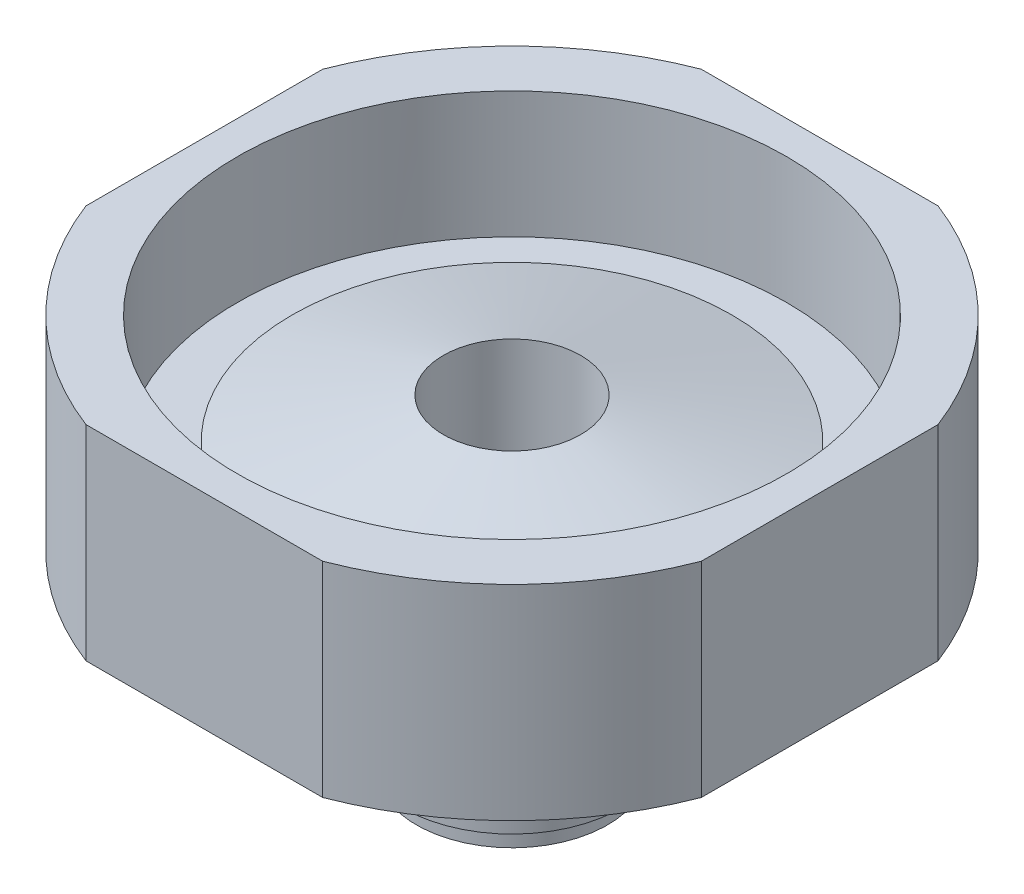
ISO-10303-21;
HEADER;
FILE_DESCRIPTION(('STEP AP214'),'2;1');
FILE_NAME('part.step','',(''),(''),'','','');
FILE_SCHEMA(('AUTOMOTIVE_DESIGN { 1 0 10303 214 1 1 1 1 }'));
ENDSEC;
DATA;
#1=APPLICATION_CONTEXT('core data for automotive mechanical design processes');
#2=APPLICATION_PROTOCOL_DEFINITION('international standard','automotive_design',2000,#1);
#3=PRODUCT_CONTEXT('',#1,'mechanical');
#4=PRODUCT('Part','Part','',(#3));
#5=PRODUCT_RELATED_PRODUCT_CATEGORY('part','',(#4));
#6=PRODUCT_DEFINITION_FORMATION('','',#4);
#7=PRODUCT_DEFINITION_CONTEXT('part definition',#1,'design');
#8=PRODUCT_DEFINITION('design','',#6,#7);
#9=PRODUCT_DEFINITION_SHAPE('','',#8);
#10=(LENGTH_UNIT() NAMED_UNIT(*) SI_UNIT(.MILLI.,.METRE.));
#11=(NAMED_UNIT(*) PLANE_ANGLE_UNIT() SI_UNIT($,.RADIAN.));
#12=(NAMED_UNIT(*) SI_UNIT($,.STERADIAN.) SOLID_ANGLE_UNIT());
#13=UNCERTAINTY_MEASURE_WITH_UNIT(LENGTH_MEASURE(1.E-05),#10,'distance_accuracy_value','');
#14=(GEOMETRIC_REPRESENTATION_CONTEXT(3) GLOBAL_UNCERTAINTY_ASSIGNED_CONTEXT((#13)) GLOBAL_UNIT_ASSIGNED_CONTEXT((#10,
#11,#12)) REPRESENTATION_CONTEXT('',''));
#15=CARTESIAN_POINT('',(0.,0.,0.));
#16=DIRECTION('',(0.,0.,1.));
#17=DIRECTION('',(1.,0.,0.));
#18=AXIS2_PLACEMENT_3D('',#15,#16,#17);
#19=CARTESIAN_POINT('',(0.,0.,0.));
#20=DIRECTION('',(0.,-1.,0.));
#21=DIRECTION('',(0.,0.,-0.999999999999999));
#22=AXIS2_PLACEMENT_3D('',#19,#20,#21);
#23=CYLINDRICAL_SURFACE('',#22,19.05);
#24=DIRECTION('',(0.,-1.,0.));
#25=VECTOR('',#24,1.);
#26=CARTESIAN_POINT('',(6.83915930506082,0.,17.78));
#27=LINE('',#26,#25);
#28=CARTESIAN_POINT('',(6.83915930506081,-2.29966349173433,17.78));
#29=VERTEX_POINT('',#28);
#30=CARTESIAN_POINT('',(6.83915930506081,9.52500000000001,17.78));
#31=VERTEX_POINT('',#30);
#32=EDGE_CURVE('E11',#29,#31,#27,.F.);
#33=ORIENTED_EDGE('',*,*,#32,.F.);
#34=CARTESIAN_POINT('',(0.,-2.29966349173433,0.));
#35=DIRECTION('',(0.,-1.,0.));
#36=DIRECTION('',(0.,0.,-0.999999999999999));
#37=AXIS2_PLACEMENT_3D('',#34,#35,#36);
#38=CIRCLE('',#37,19.05);
#39=CARTESIAN_POINT('',(17.7799999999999,-2.29966349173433,6.83915930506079));
#40=VERTEX_POINT('',#39);
#41=EDGE_CURVE('E138',#40,#29,#38,.T.);
#42=ORIENTED_EDGE('',*,*,#41,.F.);
#43=DIRECTION('',(0.,-1.,0.));
#44=VECTOR('',#43,1.);
#45=CARTESIAN_POINT('',(17.7799999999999,0.,6.83915930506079));
#46=LINE('',#45,#44);
#47=CARTESIAN_POINT('',(17.7799999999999,9.52500000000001,6.83915930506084));
#48=VERTEX_POINT('',#47);
#49=EDGE_CURVE('E110',#48,#40,#46,.T.);
#50=ORIENTED_EDGE('',*,*,#49,.F.);
#51=CARTESIAN_POINT('',(0.,9.52500000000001,0.));
#52=DIRECTION('',(0.,-1.,0.));
#53=DIRECTION('',(0.,0.,-0.999999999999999));
#54=AXIS2_PLACEMENT_3D('',#51,#52,#53);
#55=CIRCLE('',#54,19.05);
#56=EDGE_CURVE('E105',#48,#31,#55,.T.);
#57=ORIENTED_EDGE('',*,*,#56,.T.);
#58=EDGE_LOOP('',(#33,#42,#50,#57));
#59=FACE_BOUND('',#58,.T.);
#60=ADVANCED_FACE('F30',(#59),#23,.T.);
#61=DIRECTION('',(0.,-1.,0.));
#62=VECTOR('',#61,1.);
#63=CARTESIAN_POINT('',(-6.83915930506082,2.22044604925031E-13,-17.78));
#64=LINE('',#63,#62);
#65=CARTESIAN_POINT('',(-6.83915930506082,-2.29966349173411,-17.78));
#66=VERTEX_POINT('',#65);
#67=CARTESIAN_POINT('',(-6.83915930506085,9.52500000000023,-17.78));
#68=VERTEX_POINT('',#67);
#69=EDGE_CURVE('E52',#66,#68,#64,.F.);
#70=ORIENTED_EDGE('',*,*,#69,.F.);
#71=CARTESIAN_POINT('',(-17.78,-2.2996634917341,-6.83915930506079));
#72=VERTEX_POINT('',#71);
#73=EDGE_CURVE('E161',#72,#66,#38,.T.);
#74=ORIENTED_EDGE('',*,*,#73,.F.);
#75=DIRECTION('',(0.,-1.,0.));
#76=VECTOR('',#75,1.);
#77=CARTESIAN_POINT('',(-17.78,2.28983498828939E-13,-6.83915930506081));
#78=LINE('',#77,#76);
#79=CARTESIAN_POINT('',(-17.78,9.52500000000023,-6.83915930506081));
#80=VERTEX_POINT('',#79);
#81=EDGE_CURVE('E146',#80,#72,#78,.T.);
#82=ORIENTED_EDGE('',*,*,#81,.F.);
#83=EDGE_CURVE('E113',#80,#68,#55,.T.);
#84=ORIENTED_EDGE('',*,*,#83,.T.);
#85=EDGE_LOOP('',(#70,#74,#82,#84));
#86=FACE_BOUND('',#85,.T.);
#87=ADVANCED_FACE('F209',(#86),#23,.T.);
#88=DIRECTION('',(0.,-1.,0.));
#89=VECTOR('',#88,1.);
#90=CARTESIAN_POINT('',(6.83915930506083,0.,-17.78));
#91=LINE('',#90,#89);
#92=CARTESIAN_POINT('',(6.83915930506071,9.52500000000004,-17.7799999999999));
#93=VERTEX_POINT('',#92);
#94=CARTESIAN_POINT('',(6.83915930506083,-2.29966349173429,-17.78));
#95=VERTEX_POINT('',#94);
#96=EDGE_CURVE('E229',#93,#95,#91,.T.);
#97=ORIENTED_EDGE('',*,*,#96,.F.);
#98=CARTESIAN_POINT('',(17.7799999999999,9.52500000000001,-6.8391593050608));
#99=VERTEX_POINT('',#98);
#100=EDGE_CURVE('E117',#93,#99,#55,.T.);
#101=ORIENTED_EDGE('',*,*,#100,.T.);
#102=DIRECTION('',(0.,-1.,0.));
#103=VECTOR('',#102,1.);
#104=CARTESIAN_POINT('',(17.78,0.,-6.83915930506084));
#105=LINE('',#104,#103);
#106=CARTESIAN_POINT('',(17.7799999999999,-2.29966349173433,-6.83915930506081));
#107=VERTEX_POINT('',#106);
#108=EDGE_CURVE('E141',#107,#99,#105,.F.);
#109=ORIENTED_EDGE('',*,*,#108,.F.);
#110=EDGE_CURVE('E162',#95,#107,#38,.T.);
#111=ORIENTED_EDGE('',*,*,#110,.F.);
#112=EDGE_LOOP('',(#97,#101,#109,#111));
#113=FACE_BOUND('',#112,.T.);
#114=ADVANCED_FACE('F214',(#113),#23,.T.);
#115=CARTESIAN_POINT('',(-1.52655665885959E-13,2.34201445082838,0.));
#116=DIRECTION('',(0.,-1.,0.));
#117=DIRECTION('',(0.,0.,-0.999999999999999));
#118=AXIS2_PLACEMENT_3D('',#115,#116,#117);
#119=CONICAL_SURFACE('',#118,15.875,1.30899693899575);
#120=CARTESIAN_POINT('',(0.,5.53228452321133,0.));
#121=DIRECTION('',(0.,-1.,0.));
#122=DIRECTION('',(0.,0.,-0.999999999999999));
#123=AXIS2_PLACEMENT_3D('',#120,#121,#122);
#124=CIRCLE('',#123,3.96875);
#125=CARTESIAN_POINT('',(-1.52655665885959E-13,5.53228452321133,-3.96875000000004));
#126=VERTEX_POINT('',#125);
#127=EDGE_CURVE('E115',#126,#126,#124,.T.);
#128=CARTESIAN_POINT('',(-1.38777878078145E-13,3.19275313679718,0.));
#129=DIRECTION('',(0.,-1.,0.));
#130=DIRECTION('',(0.,0.,-0.999999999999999));
#131=AXIS2_PLACEMENT_3D('',#128,#129,#130);
#132=CIRCLE('',#131,12.7);
#133=CARTESIAN_POINT('',(-1.52655665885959E-13,3.19275313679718,-12.7));
#134=VERTEX_POINT('',#133);
#135=EDGE_CURVE('E123',#134,#134,#132,.F.);
#136=CARTESIAN_POINT('',(-1.52655665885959E-13,5.53228452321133,-3.96875000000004));
#137=CARTESIAN_POINT('',(-1.52655665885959E-13,5.50791440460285,-4.05970052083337));
#138=CARTESIAN_POINT('',(-1.52655665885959E-13,5.48354428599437,-4.15065104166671));
#139=CARTESIAN_POINT('',(-1.52655665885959E-13,5.43480404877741,-4.33255208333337));
#140=CARTESIAN_POINT('',(-1.52655665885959E-13,5.41043393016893,-4.42350260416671));
#141=CARTESIAN_POINT('',(-1.52655665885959E-13,5.36169369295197,-4.60540364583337));
#142=CARTESIAN_POINT('',(-1.52655665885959E-13,5.33732357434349,-4.6963541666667));
#143=CARTESIAN_POINT('',(-1.52655665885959E-13,5.28858333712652,-4.87825520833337));
#144=CARTESIAN_POINT('',(-1.52655665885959E-13,5.26421321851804,-4.9692057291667));
#145=CARTESIAN_POINT('',(-1.52655665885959E-13,5.21547298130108,-5.15110677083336));
#146=CARTESIAN_POINT('',(-1.52655665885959E-13,5.1911028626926,-5.2420572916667));
#147=CARTESIAN_POINT('',(-1.52655665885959E-13,5.14236262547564,-5.42395833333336));
#148=CARTESIAN_POINT('',(-1.52655665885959E-13,5.11799250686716,-5.51490885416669));
#149=CARTESIAN_POINT('',(-1.52655665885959E-13,5.0692522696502,-5.69680989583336));
#150=CARTESIAN_POINT('',(-1.52655665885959E-13,5.04488215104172,-5.78776041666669));
#151=CARTESIAN_POINT('',(-1.52655665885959E-13,4.99614191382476,-5.96966145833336));
#152=CARTESIAN_POINT('',(-1.52655665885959E-13,4.97177179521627,-6.06061197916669));
#153=CARTESIAN_POINT('',(-1.52655665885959E-13,4.92303155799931,-6.24251302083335));
#154=CARTESIAN_POINT('',(-1.52655665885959E-13,4.89866143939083,-6.33346354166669));
#155=CARTESIAN_POINT('',(-1.52655665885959E-13,4.84992120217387,-6.51536458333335));
#156=CARTESIAN_POINT('',(-1.52655665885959E-13,4.82555108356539,-6.60631510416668));
#157=CARTESIAN_POINT('',(-1.52655665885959E-13,4.77681084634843,-6.78821614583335));
#158=CARTESIAN_POINT('',(-1.52655665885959E-13,4.75244072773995,-6.87916666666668));
#159=CARTESIAN_POINT('',(-1.52655665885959E-13,4.70370049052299,-7.06106770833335));
#160=CARTESIAN_POINT('',(-1.52655665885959E-13,4.67933037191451,-7.15201822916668));
#161=CARTESIAN_POINT('',(-1.52655665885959E-13,4.63059013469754,-7.33391927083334));
#162=CARTESIAN_POINT('',(-1.52655665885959E-13,4.60622001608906,-7.42486979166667));
#163=CARTESIAN_POINT('',(-1.52655665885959E-13,4.5574797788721,-7.60677083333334));
#164=CARTESIAN_POINT('',(-1.52655665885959E-13,4.53310966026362,-7.69772135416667));
#165=CARTESIAN_POINT('',(-1.52655665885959E-13,4.48436942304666,-7.87962239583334));
#166=CARTESIAN_POINT('',(-1.52655665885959E-13,4.45999930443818,-7.97057291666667));
#167=CARTESIAN_POINT('',(-1.52655665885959E-13,4.41125906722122,-8.15247395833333));
#168=CARTESIAN_POINT('',(-1.52655665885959E-13,4.38688894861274,-8.24342447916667));
#169=CARTESIAN_POINT('',(-1.52655665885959E-13,4.33814871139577,-8.42532552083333));
#170=CARTESIAN_POINT('',(-1.52655665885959E-13,4.31377859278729,-8.51627604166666));
#171=CARTESIAN_POINT('',(-1.52655665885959E-13,4.26503835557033,-8.69817708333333));
#172=CARTESIAN_POINT('',(-1.52655665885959E-13,4.24066823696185,-8.78912760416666));
#173=CARTESIAN_POINT('',(-1.52655665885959E-13,4.19192799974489,-8.97102864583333));
#174=CARTESIAN_POINT('',(-1.52655665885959E-13,4.16755788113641,-9.06197916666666));
#175=CARTESIAN_POINT('',(-1.52655665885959E-13,4.11881764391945,-9.24388020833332));
#176=CARTESIAN_POINT('',(-1.52655665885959E-13,4.09444752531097,-9.33483072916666));
#177=CARTESIAN_POINT('',(-1.52655665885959E-13,4.045707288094,-9.51673177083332));
#178=CARTESIAN_POINT('',(-1.52655665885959E-13,4.02133716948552,-9.60768229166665));
#179=CARTESIAN_POINT('',(-1.52655665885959E-13,3.97259693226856,-9.78958333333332));
#180=CARTESIAN_POINT('',(-1.52655665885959E-13,3.94822681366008,-9.88053385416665));
#181=CARTESIAN_POINT('',(-1.52655665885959E-13,3.89948657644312,-10.0624348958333));
#182=CARTESIAN_POINT('',(-1.52655665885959E-13,3.87511645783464,-10.1533854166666));
#183=CARTESIAN_POINT('',(-1.52655665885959E-13,3.82637622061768,-10.3352864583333));
#184=CARTESIAN_POINT('',(-1.52655665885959E-13,3.8020061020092,-10.4262369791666));
#185=CARTESIAN_POINT('',(-1.52655665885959E-13,3.75326586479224,-10.6081380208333));
#186=CARTESIAN_POINT('',(-1.52655665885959E-13,3.72889574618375,-10.6990885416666));
#187=CARTESIAN_POINT('',(-1.52655665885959E-13,3.68015550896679,-10.8809895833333));
#188=CARTESIAN_POINT('',(-1.52655665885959E-13,3.65578539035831,-10.9719401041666));
#189=CARTESIAN_POINT('',(-1.52655665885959E-13,3.60704515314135,-11.1538411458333));
#190=CARTESIAN_POINT('',(-1.52655665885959E-13,3.58267503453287,-11.2447916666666));
#191=CARTESIAN_POINT('',(-1.52655665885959E-13,3.53393479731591,-11.4266927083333));
#192=CARTESIAN_POINT('',(-1.52655665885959E-13,3.50956467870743,-11.5176432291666));
#193=CARTESIAN_POINT('',(-1.52655665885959E-13,3.46082444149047,-11.6995442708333));
#194=CARTESIAN_POINT('',(-1.52655665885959E-13,3.43645432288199,-11.7904947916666));
#195=CARTESIAN_POINT('',(-1.52655665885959E-13,3.38771408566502,-11.9723958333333));
#196=CARTESIAN_POINT('',(-1.52655665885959E-13,3.36334396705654,-12.0633463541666));
#197=CARTESIAN_POINT('',(-1.52655665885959E-13,3.31460372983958,-12.2452473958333));
#198=CARTESIAN_POINT('',(-1.52655665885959E-13,3.2902336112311,-12.3361979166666));
#199=CARTESIAN_POINT('',(-1.52655665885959E-13,3.24149337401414,-12.5180989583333));
#200=CARTESIAN_POINT('',(-1.52655665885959E-13,3.21712325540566,-12.6090494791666));
#201=CARTESIAN_POINT('',(-1.52655665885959E-13,3.19275313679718,-12.7));
#202=B_SPLINE_CURVE_WITH_KNOTS('',3,(#136,#137,#138,#139,#140,#141,#142,#143,#144,#145,#146,
#147,#148,#149,#150,#151,#152,#153,#154,#155,#156,#157,#158,#159,#160,#161,#162,#163,#164,#165,
#166,#167,#168,#169,#170,#171,#172,#173,#174,#175,#176,#177,#178,#179,#180,#181,#182,#183,#184,
#185,#186,#187,#188,#189,#190,#191,#192,#193,#194,#195,#196,#197,#198,#199,#200,#201),
.UNSPECIFIED.,.F.,.F.,(4,2,2,2,2,2,2,2,2,2,2,2,2,2,2,2,2,2,2,2,2,2,2,2,2,2,2,2,2,2,2,2,4),(0.,
0.28247672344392,0.564953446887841,0.84743017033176,1.12990689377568,1.4123836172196,
1.69486034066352,1.97733706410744,2.25981378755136,2.54229051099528,2.8247672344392,
3.10724395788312,3.38972068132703,3.67219740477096,3.95467412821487,4.2371508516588,
4.51962757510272,4.80210429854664,5.08458102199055,5.36705774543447,5.64953446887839,
5.93201119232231,6.21448791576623,6.49696463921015,6.77944136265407,7.06191808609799,
7.34439480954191,7.62687153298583,7.90934825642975,8.19182497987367,8.47430170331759,
8.75677842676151,9.03925515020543),.UNSPECIFIED.);
#203=EDGE_CURVE('BSEAM190',#126,#134,#202,.T.);
#204=ORIENTED_EDGE('',*,*,#127,.T.);
#205=ORIENTED_EDGE('',*,*,#135,.T.);
#206=ORIENTED_EDGE('',*,*,#203,.T.);
#207=ORIENTED_EDGE('',*,*,#203,.F.);
#208=EDGE_LOOP('',(#204,#206,#205,#207));
#209=FACE_BOUND('',#208,.T.);
#210=ADVANCED_FACE('F190',(#209),#119,.T.);
#211=CARTESIAN_POINT('',(6.34999999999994,-2.29966349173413,0.));
#212=DIRECTION('',(0.,-1.,0.));
#213=DIRECTION('',(0.,0.,-0.999999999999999));
#214=AXIS2_PLACEMENT_3D('',#211,#212,#213);
#215=PLANE('',#214);
#216=DIRECTION('',(0.999999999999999,0.,0.));
#217=VECTOR('',#216,1.);
#218=CARTESIAN_POINT('',(6.34999999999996,-2.29966349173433,17.78));
#219=LINE('',#218,#217);
#220=CARTESIAN_POINT('',(-6.83915930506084,-2.29966349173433,17.78));
#221=VERTEX_POINT('',#220);
#222=EDGE_CURVE('E94',#221,#29,#219,.T.);
#223=ORIENTED_EDGE('',*,*,#222,.F.);
#224=CARTESIAN_POINT('',(-17.7799999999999,-2.29966349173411,6.83915930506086));
#225=VERTEX_POINT('',#224);
#226=EDGE_CURVE('E154',#221,#225,#38,.T.);
#227=ORIENTED_EDGE('',*,*,#226,.T.);
#228=DIRECTION('',(0.,0.,0.999999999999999));
#229=VECTOR('',#228,1.);
#230=CARTESIAN_POINT('',(-17.7800000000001,-2.29966349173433,0.));
#231=LINE('',#230,#229);
#232=EDGE_CURVE('E234',#72,#225,#231,.T.);
#233=ORIENTED_EDGE('',*,*,#232,.F.);
#234=ORIENTED_EDGE('',*,*,#73,.T.);
#235=DIRECTION('',(-0.999999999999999,0.,0.));
#236=VECTOR('',#235,1.);
#237=CARTESIAN_POINT('',(6.34999999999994,-2.29966349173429,-17.7799999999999));
#238=LINE('',#237,#236);
#239=EDGE_CURVE('E157',#95,#66,#238,.T.);
#240=ORIENTED_EDGE('',*,*,#239,.F.);
#241=ORIENTED_EDGE('',*,*,#110,.T.);
#242=DIRECTION('',(0.,0.,-0.999999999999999));
#243=VECTOR('',#242,1.);
#244=CARTESIAN_POINT('',(17.7799999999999,-2.29966349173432,0.));
#245=LINE('',#244,#243);
#246=EDGE_CURVE('E233',#40,#107,#245,.T.);
#247=ORIENTED_EDGE('',*,*,#246,.F.);
#248=ORIENTED_EDGE('',*,*,#41,.T.);
#249=EDGE_LOOP('',(#223,#227,#233,#234,#240,#241,#247,#248));
#250=FACE_BOUND('',#249,.T.);
#251=CARTESIAN_POINT('',(0.,-2.29966349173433,0.));
#252=DIRECTION('',(0.,-1.,0.));
#253=DIRECTION('',(0.,0.,-0.999999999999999));
#254=AXIS2_PLACEMENT_3D('',#251,#252,#253);
#255=CIRCLE('',#254,6.35);
#256=CARTESIAN_POINT('',(0.,-2.29966349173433,-6.34999999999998));
#257=VERTEX_POINT('',#256);
#258=EDGE_CURVE('E164',#257,#257,#255,.T.);
#259=ORIENTED_EDGE('',*,*,#258,.F.);
#260=EDGE_LOOP('',(#259));
#261=FACE_BOUND('',#260,.T.);
#262=ADVANCED_FACE('F32',(#250,#261),#215,.T.);
#263=CARTESIAN_POINT('',(0.,0.,0.));
#264=DIRECTION('',(0.,-1.,0.));
#265=DIRECTION('',(0.,0.,-0.999999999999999));
#266=AXIS2_PLACEMENT_3D('',#263,#264,#265);
#267=CYLINDRICAL_SURFACE('',#266,6.35);
#268=ORIENTED_EDGE('',*,*,#258,.T.);
#269=EDGE_LOOP('',(#268));
#270=FACE_BOUND('',#269,.T.);
#271=CARTESIAN_POINT('',(0.,-11.9516634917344,0.));
#272=DIRECTION('',(0.,-1.,0.));
#273=DIRECTION('',(0.,0.,-0.999999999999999));
#274=AXIS2_PLACEMENT_3D('',#271,#272,#273);
#275=CIRCLE('',#274,6.35);
#276=CARTESIAN_POINT('',(0.,-11.9516634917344,-6.34999999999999));
#277=VERTEX_POINT('',#276);
#278=EDGE_CURVE('E169',#277,#277,#275,.T.);
#279=ORIENTED_EDGE('',*,*,#278,.F.);
#280=EDGE_LOOP('',(#279));
#281=FACE_BOUND('',#280,.T.);
#282=ADVANCED_FACE('F336',(#270,#281),#267,.T.);
#283=CARTESIAN_POINT('',(6.34999999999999,-11.9516634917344,0.));
#284=DIRECTION('',(0.,-1.,0.));
#285=DIRECTION('',(0.,0.,-0.999999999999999));
#286=AXIS2_PLACEMENT_3D('',#283,#284,#285);
#287=PLANE('',#286);
#288=ORIENTED_EDGE('',*,*,#278,.T.);
#289=EDGE_LOOP('',(#288));
#290=FACE_BOUND('',#289,.T.);
#291=CARTESIAN_POINT('',(0.,-11.9516634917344,0.));
#292=DIRECTION('',(0.,-1.,0.));
#293=DIRECTION('',(0.,0.,-0.999999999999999));
#294=AXIS2_PLACEMENT_3D('',#291,#292,#293);
#295=CIRCLE('',#294,5.5245);
#296=CARTESIAN_POINT('',(0.,-11.9516634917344,-5.52449999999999));
#297=VERTEX_POINT('',#296);
#298=EDGE_CURVE('E173',#297,#297,#295,.T.);
#299=ORIENTED_EDGE('',*,*,#298,.F.);
#300=EDGE_LOOP('',(#299));
#301=FACE_BOUND('',#300,.T.);
#302=ADVANCED_FACE('F342',(#290,#301),#287,.T.);
#303=CARTESIAN_POINT('',(0.,0.,0.));
#304=DIRECTION('',(0.,-1.,0.));
#305=DIRECTION('',(0.,0.,-0.999999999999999));
#306=AXIS2_PLACEMENT_3D('',#303,#304,#305);
#307=CYLINDRICAL_SURFACE('',#306,5.5245);
#308=ORIENTED_EDGE('',*,*,#298,.T.);
#309=EDGE_LOOP('',(#308));
#310=FACE_BOUND('',#309,.T.);
#311=CARTESIAN_POINT('',(0.,-13.2216634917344,0.));
#312=DIRECTION('',(0.,-1.,0.));
#313=DIRECTION('',(0.,0.,-0.999999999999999));
#314=AXIS2_PLACEMENT_3D('',#311,#312,#313);
#315=CIRCLE('',#314,5.5245);
#316=CARTESIAN_POINT('',(0.,-13.2216634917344,-5.52449999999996));
#317=VERTEX_POINT('',#316);
#318=EDGE_CURVE('E178',#317,#317,#315,.T.);
#319=ORIENTED_EDGE('',*,*,#318,.F.);
#320=EDGE_LOOP('',(#319));
#321=FACE_BOUND('',#320,.T.);
#322=ADVANCED_FACE('F348',(#310,#321),#307,.T.);
#323=CARTESIAN_POINT('',(5.5245,-13.2216634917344,0.));
#324=DIRECTION('',(0.,-1.,0.));
#325=DIRECTION('',(0.,0.,-0.999999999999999));
#326=AXIS2_PLACEMENT_3D('',#323,#324,#325);
#327=PLANE('',#326);
#328=ORIENTED_EDGE('',*,*,#318,.T.);
#329=EDGE_LOOP('',(#328));
#330=FACE_BOUND('',#329,.T.);
#331=CARTESIAN_POINT('',(0.,-13.2216634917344,0.));
#332=DIRECTION('',(0.,-1.,0.));
#333=DIRECTION('',(0.,0.,-0.999999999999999));
#334=AXIS2_PLACEMENT_3D('',#331,#332,#333);
#335=CIRCLE('',#334,5.08);
#336=CARTESIAN_POINT('',(0.,-13.2216634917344,-5.07999999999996));
#337=VERTEX_POINT('',#336);
#338=EDGE_CURVE('E181',#337,#337,#335,.T.);
#339=ORIENTED_EDGE('',*,*,#338,.F.);
#340=EDGE_LOOP('',(#339));
#341=FACE_BOUND('',#340,.T.);
#342=ADVANCED_FACE('F204',(#330,#341),#327,.T.);
#343=CARTESIAN_POINT('',(-1.38777878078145E-13,-10.0466634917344,0.));
#344=DIRECTION('',(0.,-1.,0.));
#345=DIRECTION('',(0.,0.,-0.999999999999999));
#346=AXIS2_PLACEMENT_3D('',#343,#344,#345);
#347=CONICAL_SURFACE('',#346,3.96875,0.336674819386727);
#348=ORIENTED_EDGE('',*,*,#338,.T.);
#349=EDGE_LOOP('',(#348));
#350=FACE_BOUND('',#349,.T.);
#351=CARTESIAN_POINT('',(-1.38777878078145E-13,-10.0466634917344,0.));
#352=DIRECTION('',(0.,-1.,0.));
#353=DIRECTION('',(0.,0.,-0.999999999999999));
#354=AXIS2_PLACEMENT_3D('',#351,#352,#353);
#355=CIRCLE('',#354,3.96875);
#356=CARTESIAN_POINT('',(-1.38777878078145E-13,-10.0466634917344,-3.96874999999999));
#357=VERTEX_POINT('',#356);
#358=EDGE_CURVE('E184',#357,#357,#355,.T.);
#359=ORIENTED_EDGE('',*,*,#358,.F.);
#360=EDGE_LOOP('',(#359));
#361=FACE_BOUND('',#360,.T.);
#362=ADVANCED_FACE('F195',(#350,#361),#347,.F.);
#363=CARTESIAN_POINT('',(0.,0.,0.));
#364=DIRECTION('',(0.,-1.,0.));
#365=DIRECTION('',(0.,0.,-0.999999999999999));
#366=AXIS2_PLACEMENT_3D('',#363,#364,#365);
#367=CYLINDRICAL_SURFACE('',#366,3.96875);
#368=ORIENTED_EDGE('',*,*,#358,.T.);
#369=EDGE_LOOP('',(#368));
#370=FACE_BOUND('',#369,.T.);
#371=ORIENTED_EDGE('',*,*,#127,.F.);
#372=EDGE_LOOP('',(#371));
#373=FACE_BOUND('',#372,.T.);
#374=ADVANCED_FACE('F192',(#370,#373),#367,.F.);
#375=CARTESIAN_POINT('',(0.,0.,0.));
#376=DIRECTION('',(0.,-1.,0.));
#377=DIRECTION('',(0.,0.,-0.999999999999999));
#378=AXIS2_PLACEMENT_3D('',#375,#376,#377);
#379=CYLINDRICAL_SURFACE('',#378,15.875);
#380=CARTESIAN_POINT('',(0.,9.52500000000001,0.));
#381=DIRECTION('',(0.,-1.,0.));
#382=DIRECTION('',(0.,0.,-0.999999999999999));
#383=AXIS2_PLACEMENT_3D('',#380,#381,#382);
#384=CIRCLE('',#383,15.875);
#385=CARTESIAN_POINT('',(0.,9.52500000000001,-15.875));
#386=VERTEX_POINT('',#385);
#387=EDGE_CURVE('E111',#386,#386,#384,.T.);
#388=ORIENTED_EDGE('',*,*,#387,.F.);
#389=EDGE_LOOP('',(#388));
#390=FACE_BOUND('',#389,.T.);
#391=CARTESIAN_POINT('',(-1.52655665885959E-13,2.22250000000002,0.));
#392=DIRECTION('',(0.,1.,0.));
#393=DIRECTION('',(0.,0.,0.999999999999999));
#394=AXIS2_PLACEMENT_3D('',#391,#392,#393);
#395=CIRCLE('',#394,15.875);
#396=CARTESIAN_POINT('',(-1.52655665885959E-13,2.22250000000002,15.875));
#397=VERTEX_POINT('',#396);
#398=EDGE_CURVE('E130',#397,#397,#395,.T.);
#399=ORIENTED_EDGE('',*,*,#398,.F.);
#400=EDGE_LOOP('',(#399));
#401=FACE_BOUND('',#400,.T.);
#402=ADVANCED_FACE('F194',(#390,#401),#379,.F.);
#403=CARTESIAN_POINT('',(19.05,9.5250000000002,0.));
#404=DIRECTION('',(0.,1.,0.));
#405=DIRECTION('',(0.,0.,0.999999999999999));
#406=AXIS2_PLACEMENT_3D('',#403,#404,#405);
#407=PLANE('',#406);
#408=DIRECTION('',(-0.999999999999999,0.,0.));
#409=VECTOR('',#408,1.);
#410=CARTESIAN_POINT('',(-9.16228482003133,9.52500000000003,17.78));
#411=LINE('',#410,#409);
#412=CARTESIAN_POINT('',(-6.8391593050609,9.52500000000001,17.78));
#413=VERTEX_POINT('',#412);
#414=EDGE_CURVE('E44',#31,#413,#411,.T.);
#415=ORIENTED_EDGE('',*,*,#414,.F.);
#416=ORIENTED_EDGE('',*,*,#56,.F.);
#417=DIRECTION('',(0.,0.,0.999999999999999));
#418=VECTOR('',#417,1.);
#419=CARTESIAN_POINT('',(17.7799999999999,9.52500000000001,0.));
#420=LINE('',#419,#418);
#421=EDGE_CURVE('E231',#99,#48,#420,.T.);
#422=ORIENTED_EDGE('',*,*,#421,.F.);
#423=ORIENTED_EDGE('',*,*,#100,.F.);
#424=DIRECTION('',(0.999999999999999,0.,0.));
#425=VECTOR('',#424,1.);
#426=CARTESIAN_POINT('',(19.05,9.52500000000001,-17.78));
#427=LINE('',#426,#425);
#428=EDGE_CURVE('E148',#68,#93,#427,.T.);
#429=ORIENTED_EDGE('',*,*,#428,.F.);
#430=ORIENTED_EDGE('',*,*,#83,.F.);
#431=DIRECTION('',(0.,0.,-0.999999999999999));
#432=VECTOR('',#431,1.);
#433=CARTESIAN_POINT('',(-17.78,9.52500000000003,0.));
#434=LINE('',#433,#432);
#435=CARTESIAN_POINT('',(-17.78,9.52500000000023,6.83915930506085));
#436=VERTEX_POINT('',#435);
#437=EDGE_CURVE('E237',#436,#80,#434,.T.);
#438=ORIENTED_EDGE('',*,*,#437,.F.);
#439=EDGE_CURVE('E107',#413,#436,#55,.T.);
#440=ORIENTED_EDGE('',*,*,#439,.F.);
#441=EDGE_LOOP('',(#415,#416,#422,#423,#429,#430,#438,#440));
#442=FACE_BOUND('',#441,.T.);
#443=ORIENTED_EDGE('',*,*,#387,.T.);
#444=EDGE_LOOP('',(#443));
#445=FACE_BOUND('',#444,.T.);
#446=ADVANCED_FACE('F102',(#442,#445),#407,.T.);
#447=DIRECTION('',(0.,-1.,0.));
#448=VECTOR('',#447,1.);
#449=CARTESIAN_POINT('',(-6.83915930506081,0.,17.78));
#450=LINE('',#449,#448);
#451=EDGE_CURVE('E38',#413,#221,#450,.T.);
#452=ORIENTED_EDGE('',*,*,#451,.F.);
#453=ORIENTED_EDGE('',*,*,#439,.T.);
#454=DIRECTION('',(0.,-1.,0.));
#455=VECTOR('',#454,1.);
#456=CARTESIAN_POINT('',(-17.78,2.22044604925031E-13,6.83915930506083));
#457=LINE('',#456,#455);
#458=EDGE_CURVE('E143',#225,#436,#457,.F.);
#459=ORIENTED_EDGE('',*,*,#458,.F.);
#460=ORIENTED_EDGE('',*,*,#226,.F.);
#461=EDGE_LOOP('',(#452,#453,#459,#460));
#462=FACE_BOUND('',#461,.T.);
#463=ADVANCED_FACE('F160',(#462),#23,.T.);
#464=CARTESIAN_POINT('',(-1.52655665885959E-13,2.22250000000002,0.));
#465=DIRECTION('',(0.,1.,0.));
#466=DIRECTION('',(0.,0.,0.999999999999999));
#467=AXIS2_PLACEMENT_3D('',#464,#465,#466);
#468=PLANE('',#467);
#469=CARTESIAN_POINT('',(-1.52655665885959E-13,2.22250000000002,0.));
#470=DIRECTION('',(0.,1.,0.));
#471=DIRECTION('',(0.,0.,0.999999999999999));
#472=AXIS2_PLACEMENT_3D('',#469,#470,#471);
#473=CIRCLE('',#472,12.7);
#474=CARTESIAN_POINT('',(-1.52655665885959E-13,2.22250000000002,12.7));
#475=VERTEX_POINT('',#474);
#476=EDGE_CURVE('E135',#475,#475,#473,.T.);
#477=ORIENTED_EDGE('',*,*,#476,.F.);
#478=EDGE_LOOP('',(#477));
#479=FACE_BOUND('',#478,.T.);
#480=ORIENTED_EDGE('',*,*,#398,.T.);
#481=EDGE_LOOP('',(#480));
#482=FACE_BOUND('',#481,.T.);
#483=ADVANCED_FACE('F218',(#479,#482),#468,.T.);
#484=CARTESIAN_POINT('',(-1.52655665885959E-13,2.22250000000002,0.));
#485=DIRECTION('',(0.,1.,0.));
#486=DIRECTION('',(0.,0.,0.999999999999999));
#487=AXIS2_PLACEMENT_3D('',#484,#485,#486);
#488=CYLINDRICAL_SURFACE('',#487,12.7);
#489=ORIENTED_EDGE('',*,*,#135,.F.);
#490=EDGE_LOOP('',(#489));
#491=FACE_BOUND('',#490,.T.);
#492=ORIENTED_EDGE('',*,*,#476,.T.);
#493=EDGE_LOOP('',(#492));
#494=FACE_BOUND('',#493,.T.);
#495=ADVANCED_FACE('F223',(#491,#494),#488,.T.);
#496=CARTESIAN_POINT('',(17.7799999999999,-13.2216634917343,0.));
#497=DIRECTION('',(-0.999999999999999,0.,0.));
#498=DIRECTION('',(0.,0.,0.999999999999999));
#499=AXIS2_PLACEMENT_3D('',#496,#497,#498);
#500=PLANE('',#499);
#501=ORIENTED_EDGE('',*,*,#246,.T.);
#502=ORIENTED_EDGE('',*,*,#108,.T.);
#503=ORIENTED_EDGE('',*,*,#421,.T.);
#504=ORIENTED_EDGE('',*,*,#49,.T.);
#505=EDGE_LOOP('',(#501,#502,#503,#504));
#506=FACE_BOUND('',#505,.T.);
#507=ADVANCED_FACE('F248',(#506),#500,.F.);
#508=CARTESIAN_POINT('',(-17.78,-13.2216634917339,0.));
#509=DIRECTION('',(0.999999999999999,0.,0.));
#510=DIRECTION('',(0.,0.,-0.999999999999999));
#511=AXIS2_PLACEMENT_3D('',#508,#509,#510);
#512=PLANE('',#511);
#513=ORIENTED_EDGE('',*,*,#232,.T.);
#514=ORIENTED_EDGE('',*,*,#458,.T.);
#515=ORIENTED_EDGE('',*,*,#437,.T.);
#516=ORIENTED_EDGE('',*,*,#81,.T.);
#517=EDGE_LOOP('',(#513,#514,#515,#516));
#518=FACE_BOUND('',#517,.T.);
#519=ADVANCED_FACE('F254',(#518),#512,.F.);
#520=CARTESIAN_POINT('',(0.,-13.2216634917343,-17.78));
#521=DIRECTION('',(0.,0.,0.999999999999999));
#522=DIRECTION('',(0.999999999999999,0.,0.));
#523=AXIS2_PLACEMENT_3D('',#520,#521,#522);
#524=PLANE('',#523);
#525=ORIENTED_EDGE('',*,*,#69,.T.);
#526=ORIENTED_EDGE('',*,*,#428,.T.);
#527=ORIENTED_EDGE('',*,*,#96,.T.);
#528=ORIENTED_EDGE('',*,*,#239,.T.);
#529=EDGE_LOOP('',(#525,#526,#527,#528));
#530=FACE_BOUND('',#529,.T.);
#531=ADVANCED_FACE('F259',(#530),#524,.F.);
#532=CARTESIAN_POINT('',(-9.16228482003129,-13.2216634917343,17.78));
#533=DIRECTION('',(0.,0.,-0.999999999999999));
#534=DIRECTION('',(-0.999999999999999,0.,0.));
#535=AXIS2_PLACEMENT_3D('',#532,#533,#534);
#536=PLANE('',#535);
#537=ORIENTED_EDGE('',*,*,#32,.T.);
#538=ORIENTED_EDGE('',*,*,#414,.T.);
#539=ORIENTED_EDGE('',*,*,#451,.T.);
#540=ORIENTED_EDGE('',*,*,#222,.T.);
#541=EDGE_LOOP('',(#537,#538,#539,#540));
#542=FACE_BOUND('',#541,.T.);
#543=ADVANCED_FACE('F92',(#542),#536,.F.);
#544=CLOSED_SHELL('',(#60,#87,#114,#210,#262,#282,#302,#322,#342,#362,#374,#402,#446,#463,#483,
#495,#507,#519,#531,#543));
#545=MANIFOLD_SOLID_BREP('B2',#544);
#546=ADVANCED_BREP_SHAPE_REPRESENTATION('',(#18,#545),#14);
#547=SHAPE_DEFINITION_REPRESENTATION(#9,#546);
ENDSEC;
END-ISO-10303-21;
